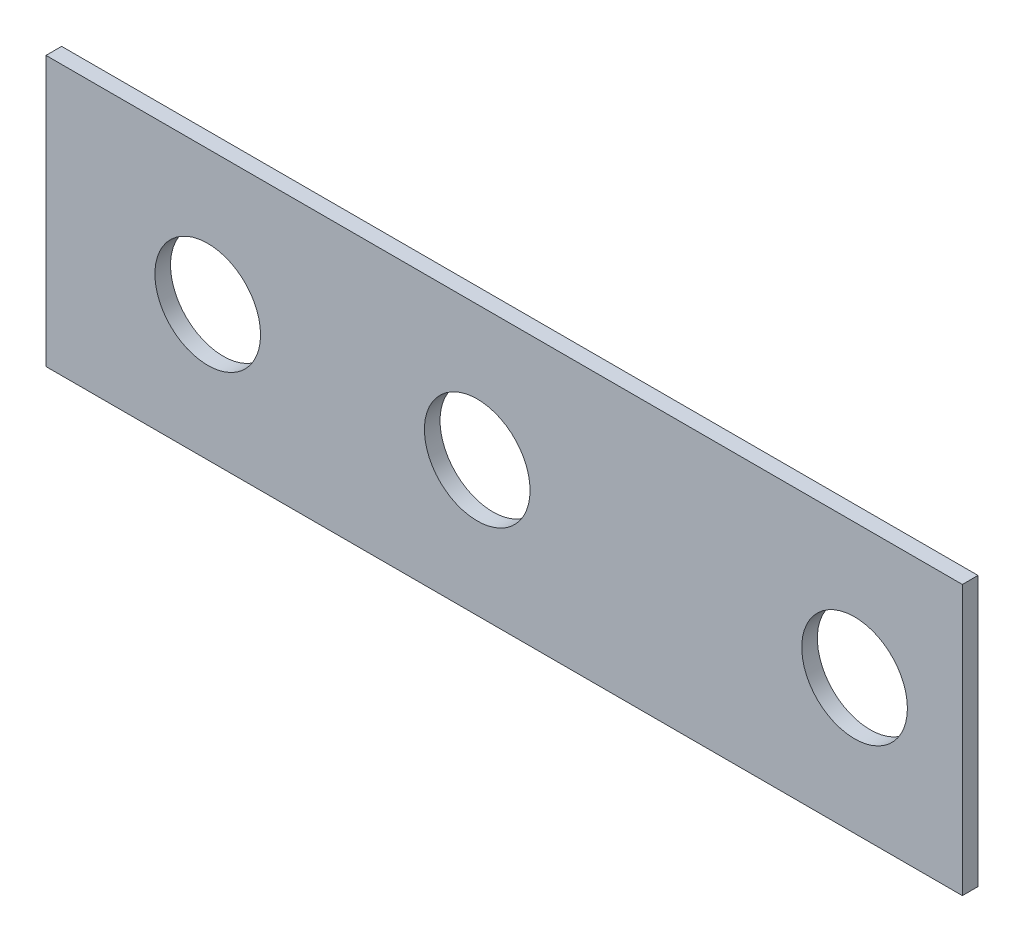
ISO-10303-21;
HEADER;
FILE_DESCRIPTION(('STEP AP214'),'2;1');
FILE_NAME('part.step','',(''),(''),'','','');
FILE_SCHEMA(('AUTOMOTIVE_DESIGN { 1 0 10303 214 1 1 1 1 }'));
ENDSEC;
DATA;
#1=APPLICATION_CONTEXT('core data for automotive mechanical design processes');
#2=APPLICATION_PROTOCOL_DEFINITION('international standard','automotive_design',2000,#1);
#3=PRODUCT_CONTEXT('',#1,'mechanical');
#4=PRODUCT('Part','Part','',(#3));
#5=PRODUCT_RELATED_PRODUCT_CATEGORY('part','',(#4));
#6=PRODUCT_DEFINITION_FORMATION('','',#4);
#7=PRODUCT_DEFINITION_CONTEXT('part definition',#1,'design');
#8=PRODUCT_DEFINITION('design','',#6,#7);
#9=PRODUCT_DEFINITION_SHAPE('','',#8);
#10=(LENGTH_UNIT() NAMED_UNIT(*) SI_UNIT(.MILLI.,.METRE.));
#11=(NAMED_UNIT(*) PLANE_ANGLE_UNIT() SI_UNIT($,.RADIAN.));
#12=(NAMED_UNIT(*) SI_UNIT($,.STERADIAN.) SOLID_ANGLE_UNIT());
#13=UNCERTAINTY_MEASURE_WITH_UNIT(LENGTH_MEASURE(1.E-05),#10,'distance_accuracy_value','');
#14=(GEOMETRIC_REPRESENTATION_CONTEXT(3) GLOBAL_UNCERTAINTY_ASSIGNED_CONTEXT((#13)) GLOBAL_UNIT_ASSIGNED_CONTEXT((#10,
#11,#12)) REPRESENTATION_CONTEXT('',''));
#15=CARTESIAN_POINT('',(0.,0.,0.));
#16=DIRECTION('',(0.,0.,1.));
#17=DIRECTION('',(1.,0.,0.));
#18=AXIS2_PLACEMENT_3D('',#15,#16,#17);
#19=CARTESIAN_POINT('',(-28.5679903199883,-25.4002690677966,-0.7366));
#20=DIRECTION('',(0.,-1.,0.));
#21=DIRECTION('',(1.,0.,0.));
#22=AXIS2_PLACEMENT_3D('',#19,#20,#21);
#23=PLANE('',#22);
#24=DIRECTION('',(1.,0.,0.));
#25=VECTOR('',#24,1.);
#26=CARTESIAN_POINT('',(-28.5679903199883,-25.4002690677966,0.));
#27=LINE('',#26,#25);
#28=CARTESIAN_POINT('',(-28.5679903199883,-25.4002690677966,0.));
#29=VERTEX_POINT('',#28);
#30=CARTESIAN_POINT('',(14.6120096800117,-25.4002690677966,0.));
#31=VERTEX_POINT('',#30);
#32=EDGE_CURVE('E97',#29,#31,#27,.T.);
#33=ORIENTED_EDGE('',*,*,#32,.F.);
#34=DIRECTION('',(0.,0.,1.));
#35=VECTOR('',#34,1.);
#36=CARTESIAN_POINT('',(-28.5679903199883,-25.4002690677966,-0.7366));
#37=LINE('',#36,#35);
#38=CARTESIAN_POINT('',(-28.5679903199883,-25.4002690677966,-0.7366));
#39=VERTEX_POINT('',#38);
#40=EDGE_CURVE('E11',#39,#29,#37,.T.);
#41=ORIENTED_EDGE('',*,*,#40,.F.);
#42=DIRECTION('',(1.,0.,0.));
#43=VECTOR('',#42,1.);
#44=CARTESIAN_POINT('',(4.45200968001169,-25.4002690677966,-0.7366));
#45=LINE('',#44,#43);
#46=CARTESIAN_POINT('',(14.6120096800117,-25.4002690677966,-0.7366));
#47=VERTEX_POINT('',#46);
#48=EDGE_CURVE('E56',#39,#47,#45,.T.);
#49=ORIENTED_EDGE('',*,*,#48,.T.);
#50=DIRECTION('',(0.,0.,1.));
#51=VECTOR('',#50,1.);
#52=CARTESIAN_POINT('',(14.6120096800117,-25.4002690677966,-0.7366));
#53=LINE('',#52,#51);
#54=EDGE_CURVE('E41',#47,#31,#53,.T.);
#55=ORIENTED_EDGE('',*,*,#54,.T.);
#56=EDGE_LOOP('',(#33,#41,#49,#55));
#57=FACE_BOUND('',#56,.T.);
#58=ADVANCED_FACE('F37',(#57),#23,.T.);
#59=CARTESIAN_POINT('',(-28.5679903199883,-12.7002690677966,-0.7366));
#60=DIRECTION('',(-1.,0.,0.));
#61=DIRECTION('',(0.,0.,1.));
#62=AXIS2_PLACEMENT_3D('',#59,#60,#61);
#63=PLANE('',#62);
#64=DIRECTION('',(0.,-1.,0.));
#65=VECTOR('',#64,1.);
#66=CARTESIAN_POINT('',(-28.5679903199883,-12.7002690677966,0.));
#67=LINE('',#66,#65);
#68=CARTESIAN_POINT('',(-28.5679903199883,-12.7002690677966,0.));
#69=VERTEX_POINT('',#68);
#70=EDGE_CURVE('E106',#69,#29,#67,.T.);
#71=ORIENTED_EDGE('',*,*,#70,.F.);
#72=DIRECTION('',(0.,0.,1.));
#73=VECTOR('',#72,1.);
#74=CARTESIAN_POINT('',(-28.5679903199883,-12.7002690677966,-0.7366));
#75=LINE('',#74,#73);
#76=CARTESIAN_POINT('',(-28.5679903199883,-12.7002690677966,-0.7366));
#77=VERTEX_POINT('',#76);
#78=EDGE_CURVE('E47',#77,#69,#75,.T.);
#79=ORIENTED_EDGE('',*,*,#78,.F.);
#80=DIRECTION('',(0.,-1.,0.));
#81=VECTOR('',#80,1.);
#82=CARTESIAN_POINT('',(-28.5679903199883,-12.7002690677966,-0.7366));
#83=LINE('',#82,#81);
#84=EDGE_CURVE('E94',#77,#39,#83,.T.);
#85=ORIENTED_EDGE('',*,*,#84,.T.);
#86=ORIENTED_EDGE('',*,*,#40,.T.);
#87=EDGE_LOOP('',(#71,#79,#85,#86));
#88=FACE_BOUND('',#87,.T.);
#89=ADVANCED_FACE('F113',(#88),#63,.T.);
#90=CARTESIAN_POINT('',(-28.5679903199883,-12.7002690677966,-0.7366));
#91=DIRECTION('',(0.,1.,0.));
#92=DIRECTION('',(0.,0.,1.));
#93=AXIS2_PLACEMENT_3D('',#90,#91,#92);
#94=PLANE('',#93);
#95=DIRECTION('',(-1.,0.,0.));
#96=VECTOR('',#95,1.);
#97=CARTESIAN_POINT('',(-28.5679903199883,-12.7002690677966,0.));
#98=LINE('',#97,#96);
#99=CARTESIAN_POINT('',(14.6120096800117,-12.7002690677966,0.));
#100=VERTEX_POINT('',#99);
#101=EDGE_CURVE('E90',#100,#69,#98,.T.);
#102=ORIENTED_EDGE('',*,*,#101,.F.);
#103=DIRECTION('',(0.,0.,1.));
#104=VECTOR('',#103,1.);
#105=CARTESIAN_POINT('',(14.6120096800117,-12.7002690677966,-0.7366));
#106=LINE('',#105,#104);
#107=CARTESIAN_POINT('',(14.6120096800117,-12.7002690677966,-0.7366));
#108=VERTEX_POINT('',#107);
#109=EDGE_CURVE('E85',#108,#100,#106,.T.);
#110=ORIENTED_EDGE('',*,*,#109,.F.);
#111=DIRECTION('',(-1.,0.,0.));
#112=VECTOR('',#111,1.);
#113=CARTESIAN_POINT('',(4.45200968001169,-12.7002690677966,-0.7366));
#114=LINE('',#113,#112);
#115=EDGE_CURVE('E88',#108,#77,#114,.T.);
#116=ORIENTED_EDGE('',*,*,#115,.T.);
#117=ORIENTED_EDGE('',*,*,#78,.T.);
#118=EDGE_LOOP('',(#102,#110,#116,#117));
#119=FACE_BOUND('',#118,.T.);
#120=ADVANCED_FACE('F87',(#119),#94,.T.);
#121=CARTESIAN_POINT('',(14.6120096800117,-12.7002690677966,-0.7366));
#122=DIRECTION('',(1.,0.,0.));
#123=DIRECTION('',(0.,0.,-1.));
#124=AXIS2_PLACEMENT_3D('',#121,#122,#123);
#125=PLANE('',#124);
#126=DIRECTION('',(0.,1.,0.));
#127=VECTOR('',#126,1.);
#128=CARTESIAN_POINT('',(14.6120096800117,-12.7002690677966,0.));
#129=LINE('',#128,#127);
#130=EDGE_CURVE('E102',#31,#100,#129,.T.);
#131=ORIENTED_EDGE('',*,*,#130,.F.);
#132=ORIENTED_EDGE('',*,*,#54,.F.);
#133=DIRECTION('',(0.,1.,0.));
#134=VECTOR('',#133,1.);
#135=CARTESIAN_POINT('',(14.6120096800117,-12.7002690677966,-0.7366));
#136=LINE('',#135,#134);
#137=EDGE_CURVE('E93',#47,#108,#136,.T.);
#138=ORIENTED_EDGE('',*,*,#137,.T.);
#139=ORIENTED_EDGE('',*,*,#109,.T.);
#140=EDGE_LOOP('',(#131,#132,#138,#139));
#141=FACE_BOUND('',#140,.T.);
#142=ADVANCED_FACE('F39',(#141),#125,.T.);
#143=CARTESIAN_POINT('',(0.,0.,-0.7366));
#144=DIRECTION('',(0.,0.,-1.));
#145=DIRECTION('',(-1.,0.,0.));
#146=AXIS2_PLACEMENT_3D('',#143,#144,#145);
#147=PLANE('',#146);
#148=CARTESIAN_POINT('',(-20.9479903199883,-19.0502690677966,-0.7366));
#149=DIRECTION('',(0.,0.,1.));
#150=DIRECTION('',(1.,0.,0.));
#151=AXIS2_PLACEMENT_3D('',#148,#149,#150);
#152=CIRCLE('',#151,2.4892);
#153=CARTESIAN_POINT('',(-18.4587903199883,-19.0502690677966,-0.7366));
#154=VERTEX_POINT('',#153);
#155=EDGE_CURVE('E144',#154,#154,#152,.T.);
#156=ORIENTED_EDGE('',*,*,#155,.T.);
#157=EDGE_LOOP('',(#156));
#158=FACE_BOUND('',#157,.T.);
#159=CARTESIAN_POINT('',(-8.24799031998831,-19.0502690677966,-0.7366));
#160=DIRECTION('',(0.,0.,1.));
#161=DIRECTION('',(1.,0.,0.));
#162=AXIS2_PLACEMENT_3D('',#159,#160,#161);
#163=CIRCLE('',#162,2.4892);
#164=CARTESIAN_POINT('',(-5.75879031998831,-19.0502690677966,-0.7366));
#165=VERTEX_POINT('',#164);
#166=EDGE_CURVE('E152',#165,#165,#163,.T.);
#167=ORIENTED_EDGE('',*,*,#166,.T.);
#168=EDGE_LOOP('',(#167));
#169=FACE_BOUND('',#168,.T.);
#170=CARTESIAN_POINT('',(9.53200968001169,-19.0502690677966,-0.7366));
#171=DIRECTION('',(0.,0.,1.));
#172=DIRECTION('',(1.,0.,0.));
#173=AXIS2_PLACEMENT_3D('',#170,#171,#172);
#174=CIRCLE('',#173,2.4892);
#175=CARTESIAN_POINT('',(12.0212096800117,-19.0502690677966,-0.7366));
#176=VERTEX_POINT('',#175);
#177=EDGE_CURVE('E104',#176,#176,#174,.T.);
#178=ORIENTED_EDGE('',*,*,#177,.T.);
#179=EDGE_LOOP('',(#178));
#180=FACE_BOUND('',#179,.T.);
#181=ORIENTED_EDGE('',*,*,#48,.F.);
#182=ORIENTED_EDGE('',*,*,#84,.F.);
#183=ORIENTED_EDGE('',*,*,#115,.F.);
#184=ORIENTED_EDGE('',*,*,#137,.F.);
#185=EDGE_LOOP('',(#181,#182,#183,#184));
#186=FACE_BOUND('',#185,.T.);
#187=ADVANCED_FACE('F92',(#158,#169,#180,#186),#147,.T.);
#188=CARTESIAN_POINT('',(0.,0.,0.));
#189=DIRECTION('',(0.,0.,-1.));
#190=DIRECTION('',(-1.,0.,0.));
#191=AXIS2_PLACEMENT_3D('',#188,#189,#190);
#192=PLANE('',#191);
#193=CARTESIAN_POINT('',(-20.9479903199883,-19.0502690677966,0.));
#194=DIRECTION('',(0.,0.,1.));
#195=DIRECTION('',(1.,0.,0.));
#196=AXIS2_PLACEMENT_3D('',#193,#194,#195);
#197=CIRCLE('',#196,2.4892);
#198=CARTESIAN_POINT('',(-18.4587903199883,-19.0502690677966,0.));
#199=VERTEX_POINT('',#198);
#200=EDGE_CURVE('E147',#199,#199,#197,.T.);
#201=ORIENTED_EDGE('',*,*,#200,.F.);
#202=EDGE_LOOP('',(#201));
#203=FACE_BOUND('',#202,.T.);
#204=CARTESIAN_POINT('',(-8.24799031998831,-19.0502690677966,0.));
#205=DIRECTION('',(0.,0.,1.));
#206=DIRECTION('',(1.,0.,0.));
#207=AXIS2_PLACEMENT_3D('',#204,#205,#206);
#208=CIRCLE('',#207,2.4892);
#209=CARTESIAN_POINT('',(-5.75879031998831,-19.0502690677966,0.));
#210=VERTEX_POINT('',#209);
#211=EDGE_CURVE('E149',#210,#210,#208,.T.);
#212=ORIENTED_EDGE('',*,*,#211,.F.);
#213=EDGE_LOOP('',(#212));
#214=FACE_BOUND('',#213,.T.);
#215=CARTESIAN_POINT('',(9.53200968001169,-19.0502690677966,0.));
#216=DIRECTION('',(0.,0.,1.));
#217=DIRECTION('',(1.,0.,0.));
#218=AXIS2_PLACEMENT_3D('',#215,#216,#217);
#219=CIRCLE('',#218,2.4892);
#220=CARTESIAN_POINT('',(12.0212096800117,-19.0502690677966,0.));
#221=VERTEX_POINT('',#220);
#222=EDGE_CURVE('E155',#221,#221,#219,.T.);
#223=ORIENTED_EDGE('',*,*,#222,.F.);
#224=EDGE_LOOP('',(#223));
#225=FACE_BOUND('',#224,.T.);
#226=ORIENTED_EDGE('',*,*,#32,.T.);
#227=ORIENTED_EDGE('',*,*,#130,.T.);
#228=ORIENTED_EDGE('',*,*,#101,.T.);
#229=ORIENTED_EDGE('',*,*,#70,.T.);
#230=EDGE_LOOP('',(#226,#227,#228,#229));
#231=FACE_BOUND('',#230,.T.);
#232=ADVANCED_FACE('F111',(#203,#214,#225,#231),#192,.F.);
#233=CARTESIAN_POINT('',(9.53200968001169,-19.0502690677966,-0.7366));
#234=DIRECTION('',(0.,0.,1.));
#235=DIRECTION('',(1.,0.,0.));
#236=AXIS2_PLACEMENT_3D('',#233,#234,#235);
#237=CYLINDRICAL_SURFACE('',#236,2.4892);
#238=ORIENTED_EDGE('',*,*,#177,.F.);
#239=EDGE_LOOP('',(#238));
#240=FACE_BOUND('',#239,.T.);
#241=ORIENTED_EDGE('',*,*,#222,.T.);
#242=EDGE_LOOP('',(#241));
#243=FACE_BOUND('',#242,.T.);
#244=ADVANCED_FACE('F124',(#240,#243),#237,.F.);
#245=CARTESIAN_POINT('',(-8.24799031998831,-19.0502690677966,-0.7366));
#246=DIRECTION('',(0.,0.,1.));
#247=DIRECTION('',(1.,0.,0.));
#248=AXIS2_PLACEMENT_3D('',#245,#246,#247);
#249=CYLINDRICAL_SURFACE('',#248,2.4892);
#250=ORIENTED_EDGE('',*,*,#166,.F.);
#251=EDGE_LOOP('',(#250));
#252=FACE_BOUND('',#251,.T.);
#253=ORIENTED_EDGE('',*,*,#211,.T.);
#254=EDGE_LOOP('',(#253));
#255=FACE_BOUND('',#254,.T.);
#256=ADVANCED_FACE('F131',(#252,#255),#249,.F.);
#257=CARTESIAN_POINT('',(-20.9479903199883,-19.0502690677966,-0.7366));
#258=DIRECTION('',(0.,0.,1.));
#259=DIRECTION('',(1.,0.,0.));
#260=AXIS2_PLACEMENT_3D('',#257,#258,#259);
#261=CYLINDRICAL_SURFACE('',#260,2.4892);
#262=ORIENTED_EDGE('',*,*,#155,.F.);
#263=EDGE_LOOP('',(#262));
#264=FACE_BOUND('',#263,.T.);
#265=ORIENTED_EDGE('',*,*,#200,.T.);
#266=EDGE_LOOP('',(#265));
#267=FACE_BOUND('',#266,.T.);
#268=ADVANCED_FACE('F135',(#264,#267),#261,.F.);
#269=CLOSED_SHELL('',(#58,#89,#120,#142,#187,#232,#244,#256,#268));
#270=MANIFOLD_SOLID_BREP('B2',#269);
#271=ADVANCED_BREP_SHAPE_REPRESENTATION('',(#18,#270),#14);
#272=SHAPE_DEFINITION_REPRESENTATION(#9,#271);
ENDSEC;
END-ISO-10303-21;
